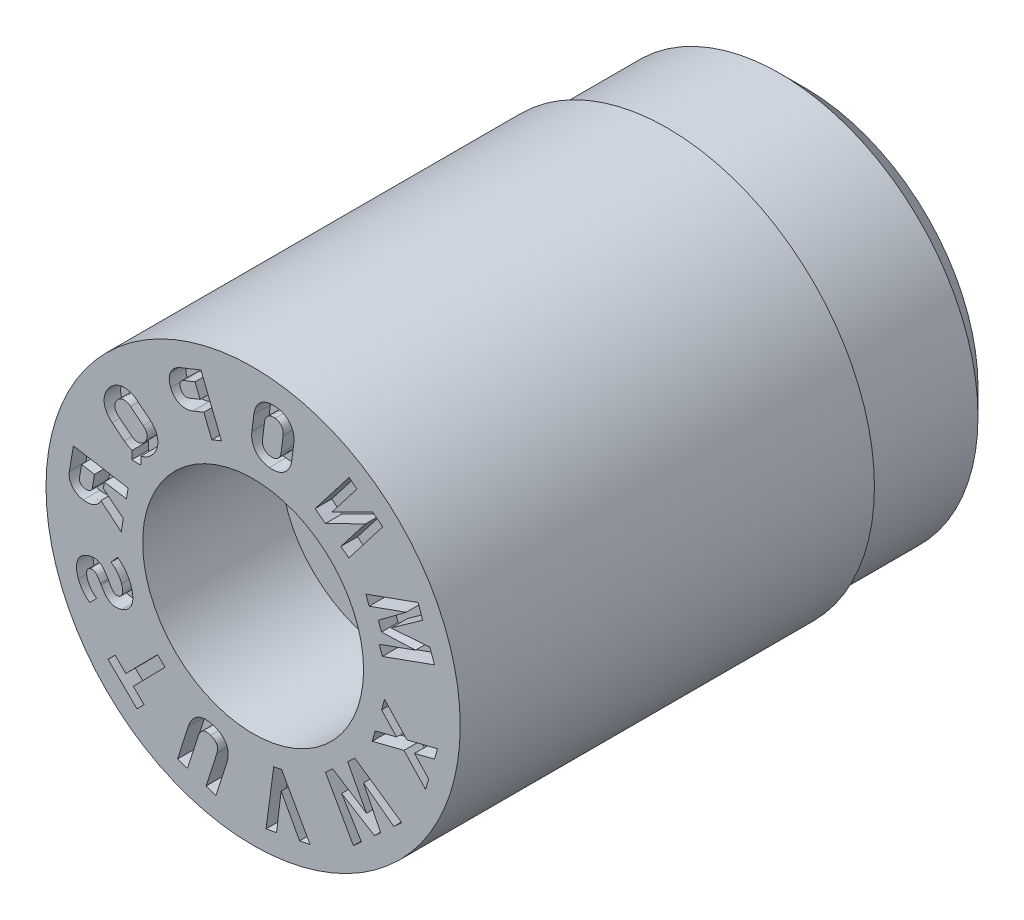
from build123d import *

# Parameters (mm, degrees)
SKETCH5_W          = 1
SKETCH5_H          = 1
CUT_EXTRUDE2_DEPTH = 0.12


with BuildPart() as part:
    # Sketch1 → Revolve1 (revolve)
    with BuildSketch(Plane(origin=(0, 0, 0), x_dir=(0, 0, -1), z_dir=(1, 0, 0)), mode=Mode.PRIVATE) as revolve1_sk:
        Polygon((0, 1.5), (0, 0.8), (1, 0.8), (1, 0.5), (4, 0.5), (4, 1.25), (3.75, 1.5), align=None)
    revolve(revolve1_sk.sketch.rotate(Axis((0, 0, 3.797909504), (0, 0, -1)), 90), axis=Axis((0, 0, 3.797909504), (0, 0, -1)))

    # Sketch5 → Cut-Revolve1 (revolve, cut)
    with BuildSketch(Plane(origin=(0, 0, 0), x_dir=(0, 0, -1), z_dir=(1, 0, 0)), mode=Mode.PRIVATE) as cut_revolve1_sk:
        with Locations((3.5, 1.935)):
            Rectangle(SKETCH5_W, SKETCH5_H)
    revolve(cut_revolve1_sk.sketch.rotate(Axis((0, 0, 0), (0, 0, -1)), 90), axis=Axis((0, 0, 0), (0, 0, -1)), mode=Mode.SUBTRACT)

    # Sketch12 → Cut-Extrude2 (cut)
    # profile 1 of 12: a face of its own
    with BuildSketch(Plane.XY):
        Polygon((0.884991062, -0.33910651), (0.86274377, -0.415652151), (1.092593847, -0.357790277), (1.248902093, -0.524528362), (1.271149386, -0.447982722), (1.168641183, -0.338653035), (1.313500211, -0.302220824), (1.335816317, -0.225718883), (1.114629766, -0.281293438), (0.952306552, -0.107806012), (0.930015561, -0.184420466), (1.038814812, -0.300367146), align=None)
    # profile 2 of 12: a face of its own
    with BuildSketch(Plane.XY):
        Polygon((1.28027881, 0.383026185), (0.999694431, 0.363417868), (1.228500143, 0.527007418), (1.19477262, 0.620758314), (0.816894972, 0.48484686), (0.840182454, 0.420224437), (1.10862469, 0.516771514), (0.907323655, 0.365630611), (0.929908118, 0.302753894), (1.17620514, 0.312736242), (0.912904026, 0.218038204), (0.93618063, 0.153301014), (1.314058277, 0.289212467), align=None)
    # profile 3 of 12: a face of its own
    with BuildSketch(Plane.XY):
        Polygon((0.635988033, 0.693555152), (0.693311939, 0.649291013), (0.938806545, 0.967385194), (0.865515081, 1.023970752), (0.572325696, 0.878214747), (0.752265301, 1.11134949), (0.694941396, 1.155613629), (0.449446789, 0.837519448), (0.523256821, 0.780564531), (0.813121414, 0.923096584), align=None)
    # profile 4 of 12: a face of its own
    with BuildSketch(Plane.XY):
        with BuildLine():
            Line((0.005179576, 1.205595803), (-0.009033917, 1.093270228))
            add(Edge.make_bspline(
                [(-0.009033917, 1.093270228), (-0.009948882, 1.086200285), (-0.010712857, 1.075670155), (-0.010492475, 1.061778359), (-0.009828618, 1.051744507), (-0.008445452, 1.041959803), (-0.006511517, 1.032438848), (-0.004020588, 1.023164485), (-0.000831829, 1.014229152), (0.002821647, 1.005568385), (0.007147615, 0.997360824), (0.011783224, 0.989419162), (0.01725056, 0.982108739), (0.022959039, 0.975014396), (0.029332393, 0.968404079), (0.036201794, 0.962196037), (0.043577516, 0.956420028), (0.051396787, 0.951145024), (0.059593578, 0.946324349), (0.068231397, 0.942064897), (0.077301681, 0.938463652), (0.08669533, 0.935143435), (0.099955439, 0.931540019), (0.110253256, 0.929781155), (0.117223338, 0.928864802)],
                knots=[0, 0, 0, 0, 0.091567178, 0.135340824, 0.178384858, 0.220643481, 0.262164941, 0.303117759, 0.343870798, 0.383941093, 0.423736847, 0.462977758, 0.501900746, 0.540853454, 0.579884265, 0.619693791, 0.65970324, 0.700108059, 0.740762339, 0.781764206, 0.823671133, 0.86604634, 0.909679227, 1, 1, 1, 1], degree=3))
            add(Edge.make_bspline(
                [(0.117223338, 0.928864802), (0.124185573, 0.928004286), (0.134570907, 0.927182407), (0.148312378, 0.927400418), (0.158228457, 0.928228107), (0.167918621, 0.929527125), (0.177344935, 0.931474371), (0.186520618, 0.93410184), (0.195438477, 0.937290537), (0.204036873, 0.941020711), (0.212210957, 0.945328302), (0.219995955, 0.950134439), (0.227408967, 0.955432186), (0.234408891, 0.961315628), (0.240947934, 0.967760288), (0.247113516, 0.974696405), (0.252889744, 0.982118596), (0.258196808, 0.990000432), (0.262977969, 0.998332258), (0.267090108, 1.007112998), (0.270928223, 1.016197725), (0.27411066, 1.025732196), (0.277643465, 1.039170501), (0.279506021, 1.049557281), (0.280412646, 1.056612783)],
                knots=[0, 0, 0, 0, 0.090141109, 0.133585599, 0.176418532, 0.21790603, 0.259120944, 0.299952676, 0.340423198, 0.380714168, 0.42025722, 0.459017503, 0.498170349, 0.537207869, 0.576360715, 0.616016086, 0.656352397, 0.697093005, 0.737996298, 0.77962015, 0.821582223, 0.864633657, 0.908618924, 1, 1, 1, 1], degree=3))
            Line((0.280412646, 1.056612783), (0.29462614, 1.168938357))
            add(Edge.make_bspline(
                [(0.29462614, 1.168938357), (0.295542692, 1.17600852), (0.296302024, 1.18653801), (0.296089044, 1.200430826), (0.29540736, 1.210426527), (0.294105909, 1.220186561), (0.292158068, 1.229669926), (0.289672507, 1.238944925), (0.286482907, 1.24788052), (0.282827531, 1.256539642), (0.278509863, 1.264753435), (0.273834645, 1.272687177), (0.268478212, 1.280081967), (0.262657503, 1.287087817), (0.256324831, 1.293710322), (0.249447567, 1.299912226), (0.242073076, 1.305688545), (0.234235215, 1.310983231), (0.22600075, 1.31579423), (0.217350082, 1.320026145), (0.208335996, 1.32377579), (0.198944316, 1.327038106), (0.185692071, 1.330660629), (0.175418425, 1.332415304), (0.168447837, 1.3333235)],
                knots=[0, 0, 0, 0, 0.091603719, 0.135394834, 0.178456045, 0.220276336, 0.261814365, 0.302783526, 0.343552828, 0.383639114, 0.423450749, 0.462707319, 0.501869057, 0.540631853, 0.57967824, 0.619503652, 0.659529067, 0.69995001, 0.74095635, 0.78197458, 0.823600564, 0.866340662, 0.90964185, 1, 1, 1, 1], degree=3))
            add(Edge.make_bspline(
                [(0.168447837, 1.3333235), (0.161458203, 1.334172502), (0.151048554, 1.33502815), (0.137305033, 1.334814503), (0.127381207, 1.333957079), (0.117711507, 1.332612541), (0.108284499, 1.330619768), (0.099129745, 1.328009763), (0.090212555, 1.324818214), (0.081613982, 1.321088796), (0.073439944, 1.316781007), (0.065654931, 1.311974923), (0.058241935, 1.306677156), (0.051241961, 1.300793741), (0.044703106, 1.29434899), (0.038536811, 1.287413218), (0.032763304, 1.279989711), (0.027445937, 1.272112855), (0.022714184, 1.263780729), (0.018461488, 1.255091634), (0.014672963, 1.246006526), (0.011479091, 1.236477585), (0.007950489, 1.223037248), (0.006085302, 1.21265174), (0.005179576, 1.205595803)],
                knots=[0, 0, 0, 0, 0.09049356, 0.133943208, 0.176451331, 0.218399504, 0.259306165, 0.300142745, 0.340618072, 0.380913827, 0.420461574, 0.459226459, 0.498383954, 0.537426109, 0.576583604, 0.616243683, 0.656584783, 0.697330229, 0.738238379, 0.779593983, 0.821561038, 0.864617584, 0.908608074, 1, 1, 1, 1], degree=3))
        make_face()
        with BuildLine():
            Line((0.217496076, 1.180590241), (0.202823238, 1.064511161))
            add(Edge.make_bspline(
                [(0.202823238, 1.064511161), (0.20195571, 1.057988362), (0.199867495, 1.048445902), (0.194833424, 1.036736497), (0.190104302, 1.028965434), (0.184600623, 1.022041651), (0.178169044, 1.016178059), (0.171106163, 1.01120169), (0.163223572, 1.007392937), (0.154779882, 1.004703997), (0.142580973, 1.002478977), (0.133084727, 1.002749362), (0.126723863, 1.003517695)],
                knots=[0, 0, 0, 0, 0.179794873, 0.264668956, 0.346798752, 0.427461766, 0.505232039, 0.583594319, 0.662519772, 0.743189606, 0.824835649, 1, 1, 1, 1], degree=3))
            add(Edge.make_bspline(
                [(0.126723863, 1.003517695), (0.12038991, 1.004442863), (0.111052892, 1.006410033), (0.099808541, 1.01166799), (0.092269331, 1.016355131), (0.085617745, 1.022009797), (0.079997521, 1.028585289), (0.075337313, 1.035905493), (0.071655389, 1.04398181), (0.06903599, 1.052689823), (0.067101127, 1.065304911), (0.067338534, 1.075049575), (0.068175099, 1.081598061)],
                knots=[0, 0, 0, 0, 0.17522073, 0.25737021, 0.337546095, 0.416780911, 0.494513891, 0.572659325, 0.652773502, 0.735916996, 0.819918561, 1, 1, 1, 1], degree=3))
            Line((0.068175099, 1.081598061), (0.082847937, 1.197677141))
            add(Edge.make_bspline(
                [(0.082847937, 1.197677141), (0.083762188, 1.204178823), (0.085711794, 1.2137597), (0.090939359, 1.225356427), (0.095609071, 1.23313672), (0.10116876, 1.240017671), (0.107441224, 1.246035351), (0.11457827, 1.250903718), (0.122427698, 1.254678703), (0.130830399, 1.257562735), (0.143079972, 1.259647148), (0.152578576, 1.259472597), (0.158947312, 1.258670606)],
                knots=[0, 0, 0, 0, 0.179884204, 0.264188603, 0.346359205, 0.427062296, 0.505097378, 0.582938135, 0.661902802, 0.742387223, 0.824748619, 1, 1, 1, 1], degree=3))
            add(Edge.make_bspline(
                [(0.158947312, 1.258670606), (0.165265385, 1.257771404), (0.174572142, 1.255748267), (0.185865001, 1.250559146), (0.193358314, 1.24573411), (0.200041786, 1.240109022), (0.205648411, 1.233496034), (0.210398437, 1.226212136), (0.214065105, 1.218141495), (0.216633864, 1.209459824), (0.218575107, 1.196884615), (0.218329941, 1.187138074), (0.217496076, 1.180590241)],
                knots=[0, 0, 0, 0, 0.1745249, 0.257424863, 0.337850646, 0.417105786, 0.494858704, 0.573567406, 0.653702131, 0.73584926, 0.819872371, 1, 1, 1, 1], degree=3))
        make_face(mode=Mode.SUBTRACT)
    # profile 5 of 12: a face of its own
    with BuildSketch(Plane.XY):
        with BuildLine():
            add(Edge.make_bspline(
                [(-0.526380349, 1.23335247), (-0.537380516, 1.229096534), (-0.552744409, 1.22089026), (-0.570606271, 1.206809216), (-0.581787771, 1.195067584), (-0.591244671, 1.182332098), (-0.598516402, 1.168544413), (-0.603805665, 1.1539295), (-0.606893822, 1.138521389), (-0.60793069, 1.122541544), (-0.606182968, 1.100269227), (-0.601449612, 1.083846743), (-0.597193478, 1.073138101)],
                knots=[0, 0, 0, 0, 0.179319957, 0.263185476, 0.345150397, 0.425377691, 0.503840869, 0.581515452, 0.661129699, 0.742192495, 0.824477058, 1, 1, 1, 1], degree=3))
            add(Edge.make_bspline(
                [(-0.597193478, 1.073138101), (-0.592980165, 1.062417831), (-0.584987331, 1.047316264), (-0.570905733, 1.029994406), (-0.559122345, 1.019203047), (-0.546237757, 1.010296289), (-0.532392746, 1.003379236), (-0.517610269, 0.998539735), (-0.502027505, 0.995842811), (-0.485847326, 0.995220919), (-0.46322287, 0.997477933), (-0.446478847, 1.002286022), (-0.435548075, 1.006730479)],
                knots=[0, 0, 0, 0, 0.175542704, 0.258187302, 0.339120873, 0.418228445, 0.49617305, 0.574174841, 0.654434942, 0.736435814, 0.820193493, 1, 1, 1, 1], degree=3))
            Line((-0.435548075, 1.006730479), (-0.356795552, 1.038250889))
            Line((-0.356795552, 1.038250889), (-0.299208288, 0.894569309))
            Line((-0.299208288, 0.894569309), (-0.229468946, 0.922544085))
            Line((-0.229468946, 0.922544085), (-0.37788069, 1.292834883))
            Line((-0.37788069, 1.292834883), (-0.526380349, 1.23335247))
        make_face()
        with BuildLine():
            add(Edge.make_bspline(
                [(-0.464234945, 1.073200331), (-0.468163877, 1.071442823), (-0.474322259, 1.070107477), (-0.482574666, 1.069349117), (-0.488547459, 1.069966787), (-0.494326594, 1.071306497), (-0.499899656, 1.07339088), (-0.505111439, 1.076418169), (-0.510048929, 1.08014945), (-0.514524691, 1.0846953), (-0.520191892, 1.091616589), (-0.523076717, 1.097874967), (-0.524893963, 1.10208973)],
                knots=[0, 0, 0, 0, 0.169608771, 0.249379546, 0.328201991, 0.406965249, 0.48472293, 0.563634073, 0.645646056, 0.729894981, 0.816605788, 1, 1, 1, 1], degree=3))
            add(Edge.make_bspline(
                [(-0.524893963, 1.10208973), (-0.526444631, 1.106474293), (-0.528844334, 1.113028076), (-0.52951624, 1.122035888), (-0.52949424, 1.128434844), (-0.528586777, 1.13457853), (-0.526958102, 1.140391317), (-0.524495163, 1.145816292), (-0.52123711, 1.150801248), (-0.517322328, 1.155407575), (-0.51081925, 1.160697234), (-0.5052299, 1.163808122), (-0.501189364, 1.16535148)],
                knots=[0, 0, 0, 0, 0.184730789, 0.270932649, 0.355057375, 0.436743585, 0.515048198, 0.592467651, 0.670713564, 0.749311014, 0.829871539, 1, 1, 1, 1], degree=3))
            Line((-0.501189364, 1.16535148), (-0.420671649, 1.197623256))
            Line((-0.420671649, 1.197623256), (-0.38373484, 1.105465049))
            Line((-0.38373484, 1.105465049), (-0.464234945, 1.073200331))
        make_face(mode=Mode.SUBTRACT)
    # profile 6 of 12: a face of its own
    with BuildSketch(Plane.XY):
        with BuildLine():
            Line((-0.813801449, 0.47794811), (-0.811991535, 0.535413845))
            add(Edge.make_bspline(
                [(-0.811991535, 0.535413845), (-0.809962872, 0.53581376), (-0.804936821, 0.536938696), (-0.797013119, 0.539347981), (-0.788185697, 0.542516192), (-0.779532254, 0.546354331), (-0.771075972, 0.550804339), (-0.762946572, 0.556002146), (-0.754947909, 0.561682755), (-0.747209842, 0.567995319), (-0.737097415, 0.577371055), (-0.730179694, 0.585234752), (-0.725713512, 0.590701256)],
                knots=[0.553285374, 0.553285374, 0.553285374, 0.553285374, 0.579770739, 0.619239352, 0.659320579, 0.699882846, 0.740439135, 0.781638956, 0.823426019, 0.866092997, 0.909503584, 1, 1, 1, 1], degree=3))
            add(Edge.make_bspline(
                [(-0.725713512, 0.590701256), (-0.721186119, 0.596109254), (-0.715190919, 0.604657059), (-0.708022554, 0.616419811), (-0.703444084, 0.625289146), (-0.699459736, 0.63423548), (-0.696185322, 0.643317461), (-0.693599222, 0.652520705), (-0.691493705, 0.661772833), (-0.690282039, 0.671070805), (-0.689499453, 0.680305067), (-0.689565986, 0.689472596), (-0.690216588, 0.698575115), (-0.691562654, 0.707620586), (-0.69354837, 0.716611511), (-0.69621053, 0.725539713), (-0.699482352, 0.734370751), (-0.703423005, 0.74305383), (-0.707956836, 0.751548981), (-0.713225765, 0.759728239), (-0.71903512, 0.767735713), (-0.725415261, 0.775526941), (-0.734918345, 0.785703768), (-0.74284136, 0.792696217), (-0.748333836, 0.797225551)],
                knots=[0, 0, 0, 0, 0.090294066, 0.1336645, 0.176476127, 0.218138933, 0.259119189, 0.300095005, 0.340622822, 0.380615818, 0.420181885, 0.459322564, 0.497989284, 0.537074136, 0.576432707, 0.615914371, 0.656403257, 0.697052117, 0.738053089, 0.779714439, 0.821655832, 0.864806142, 0.908708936, 1, 1, 1, 1], degree=3))
            Line((-0.748333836, 0.797225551), (-0.836465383, 0.868618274))
            add(Edge.make_bspline(
                [(-0.836465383, 0.868618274), (-0.841988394, 0.873147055), (-0.850563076, 0.879346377), (-0.86248371, 0.88654672), (-0.871387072, 0.891259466), (-0.880419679, 0.895285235), (-0.889559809, 0.89857755), (-0.898776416, 0.901343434), (-0.908064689, 0.90344753), (-0.917424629, 0.904778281), (-0.926705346, 0.905597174), (-0.935915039, 0.905623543), (-0.945034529, 0.90505026), (-0.954070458, 0.90378993), (-0.963050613, 0.901886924), (-0.971947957, 0.899328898), (-0.980756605, 0.896114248), (-0.989443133, 0.892324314), (-0.997809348, 0.887715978), (-1.006054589, 0.882686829), (-1.013953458, 0.876858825), (-1.021732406, 0.870584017), (-1.031798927, 0.861180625), (-1.038830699, 0.853450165), (-1.043235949, 0.847945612)],
                knots=[0, 0, 0, 0, 0.091503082, 0.135353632, 0.178375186, 0.220512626, 0.261961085, 0.302783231, 0.343761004, 0.383862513, 0.423850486, 0.46305306, 0.501757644, 0.540854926, 0.579852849, 0.619297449, 0.659380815, 0.699945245, 0.740600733, 0.781683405, 0.823613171, 0.866282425, 0.909695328, 1, 1, 1, 1], degree=3))
            add(Edge.make_bspline(
                [(-1.043235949, 0.847945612), (-1.047592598, 0.842395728), (-1.05393012, 0.834029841), (-1.060934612, 0.822165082), (-1.065555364, 0.813314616), (-1.06943591, 0.804324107), (-1.072819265, 0.795274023), (-1.075476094, 0.786104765), (-1.07739302, 0.776843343), (-1.078817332, 0.767583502), (-1.079382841, 0.758325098), (-1.079505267, 0.749136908), (-1.078786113, 0.740001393), (-1.077452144, 0.730958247), (-1.075489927, 0.721956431), (-1.072716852, 0.71308766), (-1.069462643, 0.704249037), (-1.065503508, 0.695575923), (-1.061021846, 0.687050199), (-1.055671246, 0.678893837), (-1.049953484, 0.670849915), (-1.043477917, 0.663105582), (-1.034069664, 0.652844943), (-1.026071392, 0.645888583), (-1.020598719, 0.641341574)],
                knots=[0, 0, 0, 0, 0.090489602, 0.134095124, 0.176397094, 0.218323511, 0.259469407, 0.300118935, 0.34048573, 0.38057989, 0.420031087, 0.459226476, 0.498220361, 0.537287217, 0.576279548, 0.616118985, 0.656244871, 0.696875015, 0.738191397, 0.77950778, 0.821748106, 0.864569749, 0.90875097, 1, 1, 1, 1], degree=3))
            Line((-1.020598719, 0.641341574), (-0.932467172, 0.569948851))
            add(Edge.make_bspline(
                [(-0.932467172, 0.569948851), (-0.926942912, 0.565422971), (-0.918371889, 0.559215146), (-0.906445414, 0.552028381), (-0.897571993, 0.547286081), (-0.88848373, 0.543393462), (-0.88160162, 0.540804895), (-0.877725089, 0.539532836), (-0.876934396, 0.539281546)],
                knots=[0, 0, 0, 0, 0.091498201, 0.135346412, 0.178365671, 0.220297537, 0.261929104, 0.272556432, 0.272556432, 0.272556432, 0.272556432], degree=3))
            Line((-0.876934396, 0.539281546), (-0.878851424, 0.478989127))
            Line((-0.878851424, 0.478989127), (-0.813801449, 0.47794811))
        make_face()
        with BuildLine():
            Line((-0.887243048, 0.809022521), (-0.796076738, 0.735106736))
            add(Edge.make_bspline(
                [(-0.796076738, 0.735106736), (-0.790985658, 0.730901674), (-0.783967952, 0.724086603), (-0.776685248, 0.713616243), (-0.772528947, 0.705528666), (-0.769595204, 0.697179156), (-0.767827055, 0.688651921), (-0.767458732, 0.680032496), (-0.768282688, 0.671330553), (-0.770530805, 0.662725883), (-0.774984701, 0.65109965), (-0.78033324, 0.643169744), (-0.784359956, 0.638180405)],
                knots=[0, 0, 0, 0, 0.180209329, 0.26452677, 0.346632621, 0.427289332, 0.505058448, 0.583105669, 0.661573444, 0.742393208, 0.824765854, 1, 1, 1, 1], degree=3))
            add(Edge.make_bspline(
                [(-0.784359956, 0.638180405), (-0.788463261, 0.633249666), (-0.79502683, 0.626296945), (-0.805462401, 0.619556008), (-0.813415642, 0.615653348), (-0.821738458, 0.61295148), (-0.830294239, 0.611538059), (-0.839031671, 0.611512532), (-0.847834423, 0.612667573), (-0.856692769, 0.614919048), (-0.868439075, 0.619963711), (-0.876695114, 0.625176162), (-0.881752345, 0.629447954)],
                knots=[0, 0, 0, 0, 0.17533374, 0.257081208, 0.337109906, 0.415953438, 0.494463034, 0.572233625, 0.652956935, 0.735672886, 0.820224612, 1, 1, 1, 1], degree=3))
            Line((-0.881752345, 0.629447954), (-0.972918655, 0.703363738))
            add(Edge.make_bspline(
                [(-0.972918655, 0.703363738), (-0.977980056, 0.707590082), (-0.98507521, 0.714336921), (-0.992237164, 0.724913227), (-0.99638422, 0.733015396), (-0.99936824, 0.741382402), (-1.000997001, 0.749937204), (-1.001400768, 0.758577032), (-1.000571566, 0.767289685), (-0.998460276, 0.77592205), (-0.993874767, 0.787486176), (-0.988595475, 0.795428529), (-0.984589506, 0.800466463)],
                knots=[0, 0, 0, 0, 0.180082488, 0.264057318, 0.346819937, 0.427419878, 0.505144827, 0.583137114, 0.662255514, 0.742695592, 0.82439241, 1, 1, 1, 1], degree=3))
            add(Edge.make_bspline(
                [(-0.984589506, 0.800466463), (-0.980565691, 0.8054753), (-0.973826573, 0.812201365), (-0.963491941, 0.81912466), (-0.95548262, 0.82301513), (-0.947131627, 0.825604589), (-0.938585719, 0.827035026), (-0.929849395, 0.827069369), (-0.921021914, 0.82595117), (-0.912237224, 0.823546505), (-0.900546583, 0.818482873), (-0.89229531, 0.813300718), (-0.887243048, 0.809022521)],
                knots=[0, 0, 0, 0, 0.175041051, 0.257091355, 0.337870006, 0.416671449, 0.494472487, 0.572998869, 0.653753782, 0.736177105, 0.82015423, 1, 1, 1, 1], degree=3))
        make_face(mode=Mode.SUBTRACT)
    # profile 7 of 12: a face of its own
    with BuildSketch(Plane.XY):
        with BuildLine():
            add(Edge.make_bspline(
                [(-1.330604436, 0.181385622), (-1.332388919, 0.171081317), (-1.33325182, 0.155539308), (-1.330092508, 0.135443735), (-1.325784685, 0.121429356), (-1.319630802, 0.108286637), (-1.311546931, 0.096314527), (-1.301859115, 0.085358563), (-1.290321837, 0.075838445), (-1.277352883, 0.067507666), (-1.257655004, 0.0582169), (-1.241436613, 0.054140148), (-1.230309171, 0.052194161)],
                knots=[0, 0, 0, 0, 0.170482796, 0.251099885, 0.330372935, 0.408660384, 0.486685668, 0.565006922, 0.646170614, 0.729617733, 0.815632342, 1, 1, 1, 1], degree=3))
            add(Edge.make_bspline(
                [(-1.230309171, 0.052194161), (-1.219138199, 0.05032312), (-1.20243993, 0.049055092), (-1.180754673, 0.051434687), (-1.165764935, 0.055133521), (-1.151798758, 0.060546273), (-1.139009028, 0.067624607), (-1.127535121, 0.076465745), (-1.117459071, 0.086907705), (-1.108957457, 0.098524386), (-1.104526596, 0.106968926), (-1.102620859, 0.111206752)],
                knots=[0, 0, 0, 0, 0.184640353, 0.27077544, 0.354394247, 0.435441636, 0.51411026, 0.591700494, 0.670508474, 0.749754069, 0.825376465, 0.825376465, 0.825376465, 0.825376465], degree=3))
            Line((-1.102620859, 0.111206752), (-0.955040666, -0.010656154))
            Line((-0.955040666, -0.010656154), (-0.940036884, 0.079826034))
            Line((-0.940036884, 0.079826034), (-1.084601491, 0.195546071))
            Line((-1.084601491, 0.195546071), (-1.077053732, 0.240948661))
            Line((-1.077053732, 0.240948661), (-0.91764173, 0.214467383))
            Line((-0.91764173, 0.214467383), (-0.905195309, 0.289113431))
            Line((-0.905195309, 0.289113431), (-1.301729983, 0.354985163))
            Line((-1.301729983, 0.354985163), (-1.330604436, 0.181385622))
        make_face()
        with BuildLine():
            add(Edge.make_bspline(
                [(-1.164455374, 0.159960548), (-1.164995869, 0.156307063), (-1.166671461, 0.151075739), (-1.170151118, 0.144749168), (-1.173523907, 0.140692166), (-1.177309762, 0.137025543), (-1.181784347, 0.134030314), (-1.186739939, 0.131574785), (-1.1922234, 0.129847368), (-1.198075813, 0.128635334), (-1.206584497, 0.127888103), (-1.213129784, 0.12849774), (-1.217538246, 0.12905492)],
                knots=[0, 0, 0, 0, 0.160219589, 0.237258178, 0.312866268, 0.389073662, 0.46597586, 0.546288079, 0.629105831, 0.715545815, 0.806121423, 1, 1, 1, 1], degree=3))
            add(Edge.make_bspline(
                [(-1.217538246, 0.12905492), (-1.221877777, 0.129819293), (-1.228262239, 0.131291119), (-1.235999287, 0.134817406), (-1.241226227, 0.137751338), (-1.245807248, 0.141205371), (-1.249760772, 0.145062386), (-1.252967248, 0.149359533), (-1.255463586, 0.15404337), (-1.257220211, 0.159015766), (-1.258463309, 0.166194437), (-1.258243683, 0.171741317), (-1.257615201, 0.175446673)],
                knots=[0, 0, 0, 0, 0.19214521, 0.282320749, 0.368983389, 0.452303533, 0.531040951, 0.608383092, 0.684451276, 0.761031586, 0.836658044, 1, 1, 1, 1], degree=3))
            Line((-1.257615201, 0.175446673), (-1.242179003, 0.268379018))
            Line((-1.242179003, 0.268379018), (-1.14901747, 0.252903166))
            Line((-1.14901747, 0.252903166), (-1.164455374, 0.159960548))
        make_face(mode=Mode.SUBTRACT)
    # profile 8 of 12: a face of its own
    with BuildSketch(Plane.XY):
        with BuildLine():
            add(Edge.make_bspline(
                [(-0.885263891, -0.310490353), (-0.888463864, -0.301584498), (-0.893694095, -0.288394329), (-0.902345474, -0.271651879), (-0.909267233, -0.259496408), (-0.916726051, -0.247830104), (-0.924798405, -0.236787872), (-0.93328728, -0.226290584), (-0.942322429, -0.21651302), (-0.951719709, -0.207407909), (-0.964596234, -0.196341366), (-0.974934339, -0.18906268), (-0.982093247, -0.184798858)],
                knots=[0, 0, 0, 0, 0.175626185, 0.262608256, 0.349360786, 0.435017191, 0.519280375, 0.602944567, 0.685282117, 0.766048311, 0.845522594, 1, 1, 1, 1], degree=3))
            Line((-0.982093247, -0.184798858), (-1.029154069, -0.238410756))
            add(Edge.make_bspline(
                [(-1.029154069, -0.238410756), (-1.020615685, -0.243722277), (-1.008315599, -0.252739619), (-0.993769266, -0.267116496), (-0.983569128, -0.279034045), (-0.97432302, -0.291881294), (-0.963241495, -0.309913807), (-0.956899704, -0.324501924), (-0.953332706, -0.334448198)],
                knots=[0, 0, 0, 0, 0.242041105, 0.365137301, 0.491373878, 0.619024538, 0.745605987, 1, 1, 1, 1], degree=3))
            add(Edge.make_bspline(
                [(-0.953332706, -0.334448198), (-0.951444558, -0.339932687), (-0.948882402, -0.348032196), (-0.94657751, -0.35880181), (-0.945323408, -0.366257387), (-0.944685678, -0.373363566), (-0.944592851, -0.380119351), (-0.945049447, -0.386549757), (-0.946043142, -0.392617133), (-0.94756339, -0.398225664), (-0.949590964, -0.40337504), (-0.952081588, -0.408060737), (-0.955265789, -0.412158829), (-0.958894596, -0.415811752), (-0.964455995, -0.420219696), (-0.969466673, -0.422359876), (-0.972841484, -0.423644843)],
                knots=[0, 0, 0, 0, 0.170231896, 0.248640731, 0.322876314, 0.391838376, 0.457681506, 0.520836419, 0.580665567, 0.637734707, 0.690915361, 0.742716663, 0.792778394, 0.842502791, 0.893513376, 1, 1, 1, 1], degree=3))
            Line((-0.972841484, -0.423644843), (-0.973083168, -0.423734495))
            add(Edge.make_bspline(
                [(-0.973083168, -0.423734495), (-0.977628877, -0.42543859), (-0.984667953, -0.42675749), (-0.993898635, -0.425847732), (-1.000111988, -0.423680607), (-1.005920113, -0.420524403), (-1.011269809, -0.416376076), (-1.016379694, -0.411508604), (-1.021092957, -0.405654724), (-1.025722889, -0.398875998), (-1.032484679, -0.388029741), (-1.037435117, -0.379242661), (-1.040796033, -0.373051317)],
                knots=[0, 0, 0, 0, 0.15536305, 0.225561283, 0.294889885, 0.364757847, 0.436568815, 0.511207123, 0.590457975, 0.67688597, 0.77420943, 1, 1, 1, 1], degree=3))
            add(Edge.make_bspline(
                [(-1.040796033, -0.373051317), (-1.041118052, -0.37263346), (-1.041593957, -0.371732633), (-1.041951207, -0.370766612), (-1.042367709, -0.370445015)],
                knots=[0, 0, 0, 0, 0.5136371, 1, 1, 1, 1], degree=3))
            Line((-1.042367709, -0.370445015), (-1.045078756, -0.364989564))
            add(Edge.make_bspline(
                [(-1.045078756, -0.364989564), (-1.051018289, -0.353994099), (-1.05990459, -0.338360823), (-1.072811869, -0.319433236), (-1.081768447, -0.307353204), (-1.091398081, -0.296828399), (-1.102529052, -0.288251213), (-1.11493113, -0.281128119), (-1.126220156, -0.276463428), (-1.135962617, -0.273833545), (-1.143754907, -0.27258523), (-1.151933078, -0.272142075), (-1.160500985, -0.272361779), (-1.169463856, -0.273466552), (-1.182327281, -0.275903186), (-1.192011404, -0.278746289), (-1.198517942, -0.281027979)],
                knots=[0, 0, 0, 0, 0.190604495, 0.273715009, 0.34913316, 0.419757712, 0.490391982, 0.562392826, 0.637307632, 0.67583317, 0.716013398, 0.75736376, 0.800527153, 0.846499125, 0.894866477, 1, 1, 1, 1], degree=3))
            Line((-1.198517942, -0.281027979), (-1.198759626, -0.281117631))
            add(Edge.make_bspline(
                [(-1.198759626, -0.281117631), (-1.204678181, -0.283147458), (-1.213196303, -0.286705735), (-1.22389588, -0.292401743), (-1.231231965, -0.297066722), (-1.238107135, -0.302070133), (-1.244568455, -0.307395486), (-1.250361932, -0.313269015), (-1.255737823, -0.319431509), (-1.260483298, -0.32599698), (-1.264758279, -0.332881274), (-1.268425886, -0.340133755), (-1.271570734, -0.347698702), (-1.274197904, -0.355566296), (-1.276148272, -0.363795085), (-1.277677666, -0.372321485), (-1.278616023, -0.381167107), (-1.279061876, -0.390305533), (-1.278766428, -0.399702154), (-1.277952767, -0.409350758), (-1.276569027, -0.419224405), (-1.274719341, -0.429402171), (-1.271378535, -0.443548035), (-1.268104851, -0.454166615), (-1.265564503, -0.461240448)],
                knots=[0, 0, 0, 0, 0.086088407, 0.126796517, 0.166690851, 0.205628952, 0.243781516, 0.281776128, 0.319038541, 0.356233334, 0.393137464, 0.430463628, 0.46795056, 0.505812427, 0.544483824, 0.584237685, 0.624961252, 0.666826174, 0.710058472, 0.754244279, 0.800037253, 0.847224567, 0.896569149, 1, 1, 1, 1], degree=3))
            add(Edge.make_bspline(
                [(-1.265564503, -0.461240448), (-1.263102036, -0.468050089), (-1.258933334, -0.478206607), (-1.25209948, -0.491286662), (-1.244491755, -0.504440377), (-1.233563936, -0.520267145), (-1.213549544, -0.543957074), (-1.195979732, -0.55941496), (-1.18344164, -0.56863241)],
                knots=[0, 0, 0, 0, 0.158441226, 0.239687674, 0.322655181, 0.490731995, 0.659584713, 1, 1, 1, 1], degree=3))
            Line((-1.18344164, -0.56863241), (-1.133727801, -0.51728068))
            add(Edge.make_bspline(
                [(-1.133727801, -0.51728068), (-1.141204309, -0.511932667), (-1.151744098, -0.503144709), (-1.164550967, -0.490258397), (-1.173188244, -0.480109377), (-1.180987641, -0.469702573), (-1.189755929, -0.455764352), (-1.194835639, -0.444734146), (-1.197495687, -0.437282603)],
                knots=[0, 0, 0, 0, 0.265538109, 0.395808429, 0.524667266, 0.650413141, 0.771401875, 1, 1, 1, 1], degree=3))
            add(Edge.make_bspline(
                [(-1.197495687, -0.437282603), (-1.199184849, -0.432082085), (-1.201756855, -0.424516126), (-1.203882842, -0.414391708), (-1.205084, -0.407410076), (-1.205671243, -0.400728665), (-1.205906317, -0.394415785), (-1.20553383, -0.388439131), (-1.204729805, -0.382834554), (-1.20335693, -0.37763397), (-1.201479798, -0.372872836), (-1.199263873, -0.368518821), (-1.196460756, -0.36467262), (-1.19320135, -0.361323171), (-1.188120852, -0.357398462), (-1.183730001, -0.355254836), (-1.180621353, -0.354177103)],
                knots=[0, 0, 0, 0, 0.173308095, 0.252155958, 0.327256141, 0.397385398, 0.464297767, 0.527010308, 0.586657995, 0.643251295, 0.696802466, 0.74841232, 0.797442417, 0.846833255, 0.895863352, 1, 1, 1, 1], degree=3))
            Line((-1.180621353, -0.354177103), (-1.180379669, -0.354087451))
            add(Edge.make_bspline(
                [(-1.180379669, -0.354087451), (-1.175420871, -0.352387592), (-1.167798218, -0.350672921), (-1.157793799, -0.351810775), (-1.151092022, -0.354185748), (-1.144923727, -0.357664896), (-1.139135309, -0.361812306), (-1.133860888, -0.366825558), (-1.128967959, -0.372771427), (-1.123982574, -0.379749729), (-1.116079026, -0.391427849), (-1.110306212, -0.4011484), (-1.106179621, -0.408027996)],
                knots=[0, 0, 0, 0, 0.156496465, 0.226661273, 0.296267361, 0.366078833, 0.436336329, 0.507184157, 0.581418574, 0.664607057, 0.761747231, 1, 1, 1, 1], degree=3))
            add(Edge.make_bspline(
                [(-1.106179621, -0.408027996), (-1.105716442, -0.408626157), (-1.105219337, -0.410047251), (-1.104328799, -0.411256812), (-1.103994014, -0.411918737)],
                knots=[0, 0, 0, 0, 0.50172254, 1, 1, 1, 1], degree=3))
            add(Edge.make_bspline(
                [(-1.103994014, -0.411918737), (-1.103465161, -0.412879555), (-1.102285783, -0.414694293), (-1.101098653, -0.416504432), (-1.100595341, -0.417449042)],
                knots=[0, 0, 0, 0, 0.50621151, 1, 1, 1, 1], degree=3))
            add(Edge.make_bspline(
                [(-1.100595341, -0.417449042), (-1.094518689, -0.427759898), (-1.085336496, -0.442357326), (-1.07217283, -0.460031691), (-1.062876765, -0.471311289), (-1.052932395, -0.481070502), (-1.041809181, -0.489108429), (-1.02948317, -0.49556812), (-1.018383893, -0.499685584), (-1.008953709, -0.502077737), (-1.001429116, -0.503084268), (-0.993612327, -0.503492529), (-0.985434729, -0.503106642), (-0.976938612, -0.502115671), (-0.964839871, -0.499864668), (-0.955804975, -0.497049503), (-0.949703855, -0.494987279)],
                knots=[0, 0, 0, 0, 0.189955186, 0.273215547, 0.349542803, 0.421678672, 0.493633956, 0.566432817, 0.641847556, 0.680908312, 0.720557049, 0.762087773, 0.804942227, 0.850275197, 0.897723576, 1, 1, 1, 1], degree=3))
            Line((-0.949703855, -0.494987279), (-0.949220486, -0.494807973))
            add(Edge.make_bspline(
                [(-0.949220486, -0.494807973), (-0.943420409, -0.492742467), (-0.934959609, -0.489271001), (-0.924494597, -0.483471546), (-0.917164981, -0.478958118), (-0.910493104, -0.473810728), (-0.904177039, -0.468431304), (-0.898551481, -0.462443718), (-0.893306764, -0.456199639), (-0.888666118, -0.449506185), (-0.884491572, -0.442494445), (-0.880937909, -0.4351124), (-0.877832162, -0.427384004), (-0.875462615, -0.419265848), (-0.873445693, -0.410857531), (-0.872123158, -0.402084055), (-0.871312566, -0.392976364), (-0.871022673, -0.383553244), (-0.871413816, -0.373883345), (-0.872225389, -0.363932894), (-0.873686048, -0.353738), (-0.875667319, -0.343249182), (-0.879348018, -0.328734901), (-0.882685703, -0.317797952), (-0.885263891, -0.310490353)],
                knots=[0, 0, 0, 0, 0.08365789, 0.123750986, 0.162374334, 0.200390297, 0.23805014, 0.274887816, 0.311788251, 0.348681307, 0.385341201, 0.422473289, 0.459813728, 0.498290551, 0.537184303, 0.577139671, 0.618625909, 0.661283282, 0.70503851, 0.749958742, 0.796779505, 0.844805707, 0.894819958, 1, 1, 1, 1], degree=3))
        make_face()
    # profile 9 of 12: a face of its own
    with BuildSketch(Plane.XY):
        Polygon((-0.921696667, -0.882818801), (-0.999511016, -0.806260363), (-1.050581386, -0.858224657), (-0.841231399, -1.064195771), (-0.790161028, -1.012231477), (-0.86791077, -0.935736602), (-0.638041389, -0.702108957), (-0.691826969, -0.649190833), align=None)
    # profile 10 of 12: a face of its own
    with BuildSketch(Plane.XY):
        with BuildLine():
            Line((-0.269027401, -1.321355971), (-0.190946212, -1.077993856))
            add(Edge.make_bspline(
                [(-0.190946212, -1.077993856), (-0.188579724, -1.070800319), (-0.185739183, -1.060003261), (-0.182892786, -1.045629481), (-0.181628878, -1.03524242), (-0.180938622, -1.025095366), (-0.180700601, -1.015183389), (-0.181382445, -1.005516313), (-0.182595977, -0.996118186), (-0.184371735, -0.98697369), (-0.186957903, -0.978179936), (-0.189978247, -0.969646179), (-0.193706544, -0.961477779), (-0.198057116, -0.953640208), (-0.203090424, -0.94619586), (-0.208614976, -0.938968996), (-0.214882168, -0.93218682), (-0.221610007, -0.925603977), (-0.229045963, -0.919591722), (-0.236940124, -0.913834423), (-0.245403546, -0.908477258), (-0.254524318, -0.903667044), (-0.267511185, -0.897475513), (-0.277826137, -0.89371053), (-0.28487807, -0.891403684)],
                knots=[0, 0, 0, 0, 0.095572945, 0.14086732, 0.184929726, 0.22759521, 0.269283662, 0.31001212, 0.349829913, 0.388912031, 0.427495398, 0.465472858, 0.503139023, 0.54074262, 0.578533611, 0.61652657, 0.655494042, 0.695043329, 0.735283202, 0.776117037, 0.81839024, 0.861631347, 0.906255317, 1, 1, 1, 1], degree=3))
            add(Edge.make_bspline(
                [(-0.28487807, -0.891403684), (-0.291997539, -0.889203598), (-0.302572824, -0.886206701), (-0.316751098, -0.883653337), (-0.326948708, -0.882359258), (-0.336948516, -0.881748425), (-0.34672278, -0.881789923), (-0.356247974, -0.88252739), (-0.365542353, -0.883816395), (-0.374522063, -0.885813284), (-0.383238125, -0.888337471), (-0.391546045, -0.891665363), (-0.399643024, -0.895428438), (-0.407349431, -0.899991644), (-0.414793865, -0.905073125), (-0.421918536, -0.910800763), (-0.428627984, -0.917211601), (-0.435095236, -0.924129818), (-0.441154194, -0.931655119), (-0.446786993, -0.939772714), (-0.452184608, -0.948373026), (-0.457003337, -0.957654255), (-0.463236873, -0.970908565), (-0.467082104, -0.981409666), (-0.469399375, -0.988612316)],
                knots=[0, 0, 0, 0, 0.094294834, 0.138719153, 0.182076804, 0.224219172, 0.265323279, 0.305579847, 0.344954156, 0.383879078, 0.421822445, 0.45956456, 0.496945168, 0.534626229, 0.572673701, 0.610859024, 0.650080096, 0.689931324, 0.730549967, 0.772129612, 0.814827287, 0.858856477, 0.904282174, 1, 1, 1, 1], degree=3))
            Line((-0.469399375, -0.988612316), (-0.547480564, -1.231974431))
            Line((-0.547480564, -1.231974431), (-0.475639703, -1.255056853))
            Line((-0.475639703, -1.255056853), (-0.39698216, -1.009903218))
            add(Edge.make_bspline(
                [(-0.39698216, -1.009903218), (-0.3953579, -1.004694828), (-0.392366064, -0.997273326), (-0.387396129, -0.988170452), (-0.383458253, -0.982091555), (-0.378909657, -0.976782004), (-0.374044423, -0.97203171), (-0.36880413, -0.967884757), (-0.363134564, -0.964493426), (-0.357158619, -0.961717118), (-0.350851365, -0.959660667), (-0.344270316, -0.958355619), (-0.33744643, -0.957647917), (-0.330359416, -0.957801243), (-0.320302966, -0.958934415), (-0.312746, -0.960851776), (-0.307686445, -0.962438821)],
                knots=[0, 0, 0, 0, 0.142255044, 0.207913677, 0.270309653, 0.33074741, 0.389819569, 0.447445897, 0.504577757, 0.561709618, 0.618968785, 0.677128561, 0.73639168, 0.797523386, 0.861602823, 1, 1, 1, 1], degree=3))
            add(Edge.make_bspline(
                [(-0.307686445, -0.962438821), (-0.302636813, -0.964146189), (-0.295275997, -0.966861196), (-0.286455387, -0.971949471), (-0.280611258, -0.976010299), (-0.275299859, -0.980407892), (-0.270797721, -0.985408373), (-0.266805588, -0.990723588), (-0.263530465, -0.996504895), (-0.260825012, -1.002585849), (-0.258999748, -1.009017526), (-0.257618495, -1.015663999), (-0.257262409, -1.022643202), (-0.257360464, -1.029885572), (-0.258531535, -1.040205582), (-0.260634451, -1.04791894), (-0.262210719, -1.053119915)],
                knots=[0, 0, 0, 0, 0.138948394, 0.202877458, 0.264372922, 0.323949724, 0.3817561, 0.438976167, 0.496535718, 0.554233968, 0.611637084, 0.670130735, 0.730403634, 0.792942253, 0.858434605, 1, 1, 1, 1], degree=3))
            Line((-0.262210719, -1.053119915), (-0.340868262, -1.298273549))
            Line((-0.340868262, -1.298273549), (-0.269027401, -1.321355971))
        make_face()
    # profile 11 of 12: a face of its own
    with BuildSketch(Plane.XY):
        Polygon((0.206982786, -0.920961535), (0.149199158, -0.932025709), (0.093611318, -1.349516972), (0.169737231, -1.33495357), (0.203100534, -1.057184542), (0.336605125, -1.30310289), (0.41280682, -1.288509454), align=None)
    # profile 12 of 12: a face of its own
    with BuildSketch(Plane.XY):
        Polygon((0.783992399, -1.085860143), (0.641377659, -0.853013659), (0.878955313, -0.999138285), (0.923854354, -0.958125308), (0.799769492, -0.708351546), (1.018728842, -0.871477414), (1.076278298, -0.818905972), (0.736891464, -0.584576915), (0.684241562, -0.632674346), (0.820912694, -0.888151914), (0.576451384, -0.731102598), (0.523801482, -0.779200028), (0.726442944, -1.138431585), align=None)
    extrude(amount=-CUT_EXTRUDE2_DEPTH, mode=Mode.SUBTRACT)


solid = part.part
